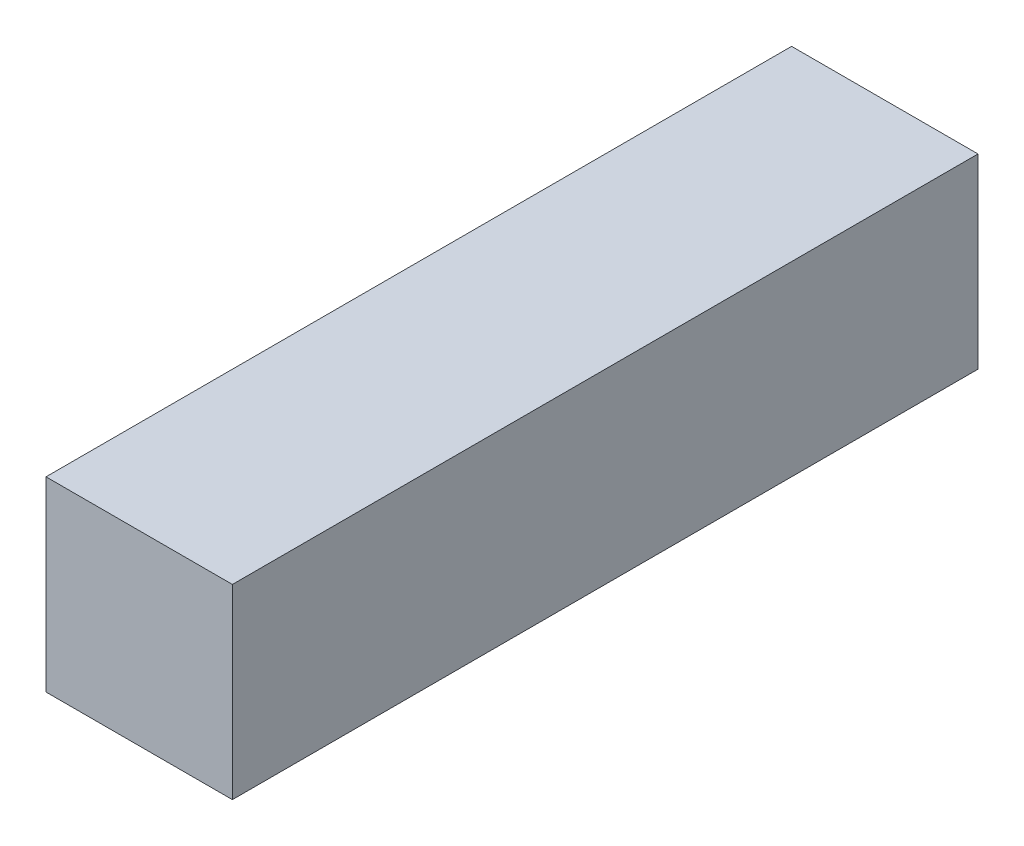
ISO-10303-21;
HEADER;
FILE_DESCRIPTION(('STEP AP214'),'2;1');
FILE_NAME('part.step','',(''),(''),'','','');
FILE_SCHEMA(('AUTOMOTIVE_DESIGN { 1 0 10303 214 1 1 1 1 }'));
ENDSEC;
DATA;
#1=APPLICATION_CONTEXT('core data for automotive mechanical design processes');
#2=APPLICATION_PROTOCOL_DEFINITION('international standard','automotive_design',2000,#1);
#3=PRODUCT_CONTEXT('',#1,'mechanical');
#4=PRODUCT('Part','Part','',(#3));
#5=PRODUCT_RELATED_PRODUCT_CATEGORY('part','',(#4));
#6=PRODUCT_DEFINITION_FORMATION('','',#4);
#7=PRODUCT_DEFINITION_CONTEXT('part definition',#1,'design');
#8=PRODUCT_DEFINITION('design','',#6,#7);
#9=PRODUCT_DEFINITION_SHAPE('','',#8);
#10=(LENGTH_UNIT() NAMED_UNIT(*) SI_UNIT(.MILLI.,.METRE.));
#11=(NAMED_UNIT(*) PLANE_ANGLE_UNIT() SI_UNIT($,.RADIAN.));
#12=(NAMED_UNIT(*) SI_UNIT($,.STERADIAN.) SOLID_ANGLE_UNIT());
#13=UNCERTAINTY_MEASURE_WITH_UNIT(LENGTH_MEASURE(1.E-05),#10,'distance_accuracy_value','');
#14=(GEOMETRIC_REPRESENTATION_CONTEXT(3) GLOBAL_UNCERTAINTY_ASSIGNED_CONTEXT((#13)) GLOBAL_UNIT_ASSIGNED_CONTEXT((#10,
#11,#12)) REPRESENTATION_CONTEXT('',''));
#15=CARTESIAN_POINT('',(0.,0.,0.));
#16=DIRECTION('',(0.,0.,1.));
#17=DIRECTION('',(1.,0.,0.));
#18=AXIS2_PLACEMENT_3D('',#15,#16,#17);
#19=CARTESIAN_POINT('',(-12.309631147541,6.87049180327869,80.));
#20=DIRECTION('',(1.,0.,0.));
#21=DIRECTION('',(0.,0.,-1.));
#22=AXIS2_PLACEMENT_3D('',#19,#20,#21);
#23=PLANE('',#22);
#24=DIRECTION('',(0.,-1.,0.));
#25=VECTOR('',#24,1.);
#26=CARTESIAN_POINT('',(-12.309631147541,6.87049180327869,0.));
#27=LINE('',#26,#25);
#28=CARTESIAN_POINT('',(-12.309631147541,6.87049180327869,0.));
#29=VERTEX_POINT('',#28);
#30=CARTESIAN_POINT('',(-12.309631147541,-13.1295081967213,0.));
#31=VERTEX_POINT('',#30);
#32=EDGE_CURVE('E392',#29,#31,#27,.T.);
#33=ORIENTED_EDGE('',*,*,#32,.T.);
#34=DIRECTION('',(0.,0.,-1.));
#35=VECTOR('',#34,1.);
#36=CARTESIAN_POINT('',(-12.309631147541,-13.1295081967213,80.));
#37=LINE('',#36,#35);
#38=CARTESIAN_POINT('',(-12.309631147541,-13.1295081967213,80.));
#39=VERTEX_POINT('',#38);
#40=EDGE_CURVE('E11',#39,#31,#37,.T.);
#41=ORIENTED_EDGE('',*,*,#40,.F.);
#42=DIRECTION('',(0.,-1.,0.));
#43=VECTOR('',#42,1.);
#44=CARTESIAN_POINT('',(-12.309631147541,6.87049180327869,80.));
#45=LINE('',#44,#43);
#46=CARTESIAN_POINT('',(-12.309631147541,6.87049180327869,80.));
#47=VERTEX_POINT('',#46);
#48=EDGE_CURVE('E410',#47,#39,#45,.T.);
#49=ORIENTED_EDGE('',*,*,#48,.F.);
#50=DIRECTION('',(0.,0.,-1.));
#51=VECTOR('',#50,1.);
#52=CARTESIAN_POINT('',(-12.309631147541,6.87049180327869,80.));
#53=LINE('',#52,#51);
#54=EDGE_CURVE('E404',#47,#29,#53,.T.);
#55=ORIENTED_EDGE('',*,*,#54,.T.);
#56=EDGE_LOOP('',(#33,#41,#49,#55));
#57=FACE_BOUND('',#56,.T.);
#58=ADVANCED_FACE('F348',(#57),#23,.F.);
#59=CARTESIAN_POINT('',(-12.309631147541,-13.1295081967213,80.));
#60=DIRECTION('',(0.,1.,0.));
#61=DIRECTION('',(0.,0.,1.));
#62=AXIS2_PLACEMENT_3D('',#59,#60,#61);
#63=PLANE('',#62);
#64=DIRECTION('',(1.,0.,0.));
#65=VECTOR('',#64,1.);
#66=CARTESIAN_POINT('',(-12.309631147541,-13.1295081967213,0.));
#67=LINE('',#66,#65);
#68=CARTESIAN_POINT('',(7.69036885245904,-13.1295081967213,0.));
#69=VERTEX_POINT('',#68);
#70=EDGE_CURVE('E388',#31,#69,#67,.T.);
#71=ORIENTED_EDGE('',*,*,#70,.T.);
#72=DIRECTION('',(0.,0.,-1.));
#73=VECTOR('',#72,1.);
#74=CARTESIAN_POINT('',(7.69036885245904,-13.1295081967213,80.));
#75=LINE('',#74,#73);
#76=CARTESIAN_POINT('',(7.69036885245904,-13.1295081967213,80.));
#77=VERTEX_POINT('',#76);
#78=EDGE_CURVE('E355',#77,#69,#75,.T.);
#79=ORIENTED_EDGE('',*,*,#78,.F.);
#80=DIRECTION('',(1.,0.,0.));
#81=VECTOR('',#80,1.);
#82=CARTESIAN_POINT('',(-12.309631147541,-13.1295081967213,80.));
#83=LINE('',#82,#81);
#84=EDGE_CURVE('E400',#39,#77,#83,.T.);
#85=ORIENTED_EDGE('',*,*,#84,.F.);
#86=ORIENTED_EDGE('',*,*,#40,.T.);
#87=EDGE_LOOP('',(#71,#79,#85,#86));
#88=FACE_BOUND('',#87,.T.);
#89=ADVANCED_FACE('F399',(#88),#63,.F.);
#90=CARTESIAN_POINT('',(7.69036885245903,6.87049180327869,80.));
#91=DIRECTION('',(-1.,0.,0.));
#92=DIRECTION('',(0.,-1.,0.));
#93=AXIS2_PLACEMENT_3D('',#90,#91,#92);
#94=PLANE('',#93);
#95=DIRECTION('',(0.,1.,0.));
#96=VECTOR('',#95,1.);
#97=CARTESIAN_POINT('',(7.69036885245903,6.87049180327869,0.));
#98=LINE('',#97,#96);
#99=CARTESIAN_POINT('',(7.69036885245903,6.87049180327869,0.));
#100=VERTEX_POINT('',#99);
#101=EDGE_CURVE('E393',#69,#100,#98,.T.);
#102=ORIENTED_EDGE('',*,*,#101,.T.);
#103=DIRECTION('',(0.,0.,-1.));
#104=VECTOR('',#103,1.);
#105=CARTESIAN_POINT('',(7.69036885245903,6.87049180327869,80.));
#106=LINE('',#105,#104);
#107=CARTESIAN_POINT('',(7.69036885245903,6.87049180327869,80.));
#108=VERTEX_POINT('',#107);
#109=EDGE_CURVE('E416',#108,#100,#106,.T.);
#110=ORIENTED_EDGE('',*,*,#109,.F.);
#111=DIRECTION('',(0.,1.,0.));
#112=VECTOR('',#111,1.);
#113=CARTESIAN_POINT('',(7.69036885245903,6.87049180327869,80.));
#114=LINE('',#113,#112);
#115=EDGE_CURVE('E367',#77,#108,#114,.T.);
#116=ORIENTED_EDGE('',*,*,#115,.F.);
#117=ORIENTED_EDGE('',*,*,#78,.T.);
#118=EDGE_LOOP('',(#102,#110,#116,#117));
#119=FACE_BOUND('',#118,.T.);
#120=ADVANCED_FACE('F419',(#119),#94,.F.);
#121=CARTESIAN_POINT('',(-12.309631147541,6.87049180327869,80.));
#122=DIRECTION('',(0.,-1.,0.));
#123=DIRECTION('',(0.,0.,-1.));
#124=AXIS2_PLACEMENT_3D('',#121,#122,#123);
#125=PLANE('',#124);
#126=DIRECTION('',(-1.,0.,0.));
#127=VECTOR('',#126,1.);
#128=CARTESIAN_POINT('',(-12.309631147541,6.87049180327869,0.));
#129=LINE('',#128,#127);
#130=EDGE_CURVE('E408',#100,#29,#129,.T.);
#131=ORIENTED_EDGE('',*,*,#130,.T.);
#132=ORIENTED_EDGE('',*,*,#54,.F.);
#133=DIRECTION('',(-1.,0.,0.));
#134=VECTOR('',#133,1.);
#135=CARTESIAN_POINT('',(-12.309631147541,6.87049180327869,80.));
#136=LINE('',#135,#134);
#137=EDGE_CURVE('E362',#108,#47,#136,.T.);
#138=ORIENTED_EDGE('',*,*,#137,.F.);
#139=ORIENTED_EDGE('',*,*,#109,.T.);
#140=EDGE_LOOP('',(#131,#132,#138,#139));
#141=FACE_BOUND('',#140,.T.);
#142=ADVANCED_FACE('F421',(#141),#125,.F.);
#143=CARTESIAN_POINT('',(-12.309631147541,-13.1295081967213,80.));
#144=DIRECTION('',(0.,0.,1.));
#145=DIRECTION('',(1.,0.,0.));
#146=AXIS2_PLACEMENT_3D('',#143,#144,#145);
#147=PLANE('',#146);
#148=ORIENTED_EDGE('',*,*,#48,.T.);
#149=ORIENTED_EDGE('',*,*,#84,.T.);
#150=ORIENTED_EDGE('',*,*,#115,.T.);
#151=ORIENTED_EDGE('',*,*,#137,.T.);
#152=EDGE_LOOP('',(#148,#149,#150,#151));
#153=FACE_BOUND('',#152,.T.);
#154=ADVANCED_FACE('F422',(#153),#147,.T.);
#155=CARTESIAN_POINT('',(-12.309631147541,-13.1295081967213,0.));
#156=DIRECTION('',(0.,0.,1.));
#157=DIRECTION('',(1.,0.,0.));
#158=AXIS2_PLACEMENT_3D('',#155,#156,#157);
#159=PLANE('',#158);
#160=ORIENTED_EDGE('',*,*,#32,.F.);
#161=ORIENTED_EDGE('',*,*,#130,.F.);
#162=ORIENTED_EDGE('',*,*,#101,.F.);
#163=ORIENTED_EDGE('',*,*,#70,.F.);
#164=EDGE_LOOP('',(#160,#161,#162,#163));
#165=FACE_BOUND('',#164,.T.);
#166=ADVANCED_FACE('F389',(#165),#159,.F.);
#167=CLOSED_SHELL('',(#58,#89,#120,#142,#154,#166));
#168=MANIFOLD_SOLID_BREP('B2',#167);
#169=ADVANCED_BREP_SHAPE_REPRESENTATION('',(#18,#168),#14);
#170=SHAPE_DEFINITION_REPRESENTATION(#9,#169);
ENDSEC;
END-ISO-10303-21;
